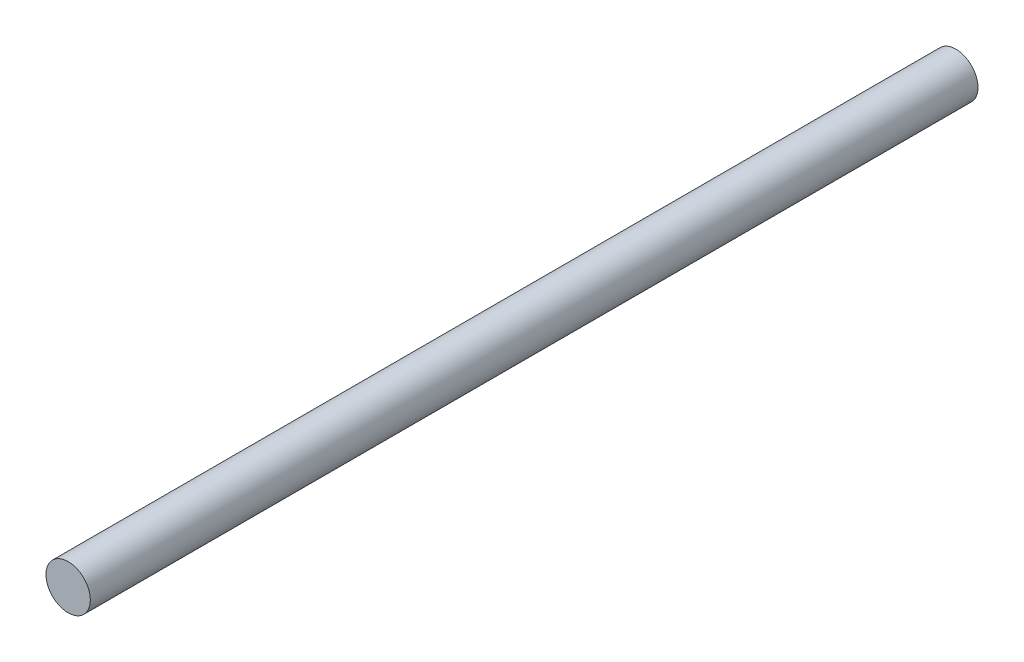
from build123d import *

# Parameters (mm, degrees)
SKETCH1_R           = 1.016
BOSS_EXTRUDE1_DEPTH = 40.64


with BuildPart() as part:
    # Sketch1 → Boss-Extrude1 (new body)
    with BuildSketch(Plane.XY):
        Circle(SKETCH1_R)
    extrude(amount=BOSS_EXTRUDE1_DEPTH)


solid = part.part
